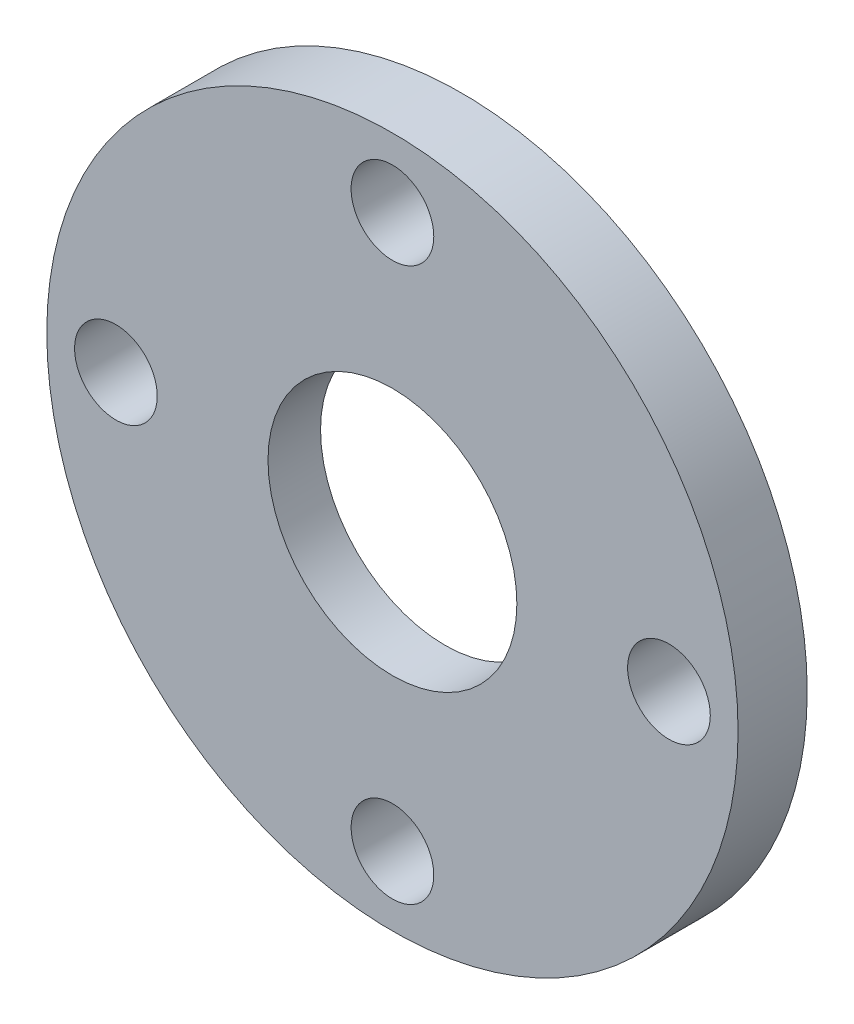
from build123d import *

# Parameters (mm, degrees)
SKETCH1_R          = 15.875
SKETCH1_R_2        = 5.715
SKETCH1_R_3        = 1.89865
BASE_EXTRUDE_DEPTH = 3.175
SKETCH2_R          = 7.9375
EXTRUDE1_DEPTH     = 0.762


with BuildPart() as part:
    # Sketch1 → Base-Extrude (new body)
    with BuildSketch(Plane.XY):
        Circle(SKETCH1_R)
        Circle(SKETCH1_R_2, mode=Mode.SUBTRACT)
        with Locations((12.7, 0)):
            Circle(SKETCH1_R_3, mode=Mode.SUBTRACT)
        with Locations((0, 12.7)):
            Circle(SKETCH1_R_3, mode=Mode.SUBTRACT)
        with Locations(Location((-12.7, 0, 0), (0, 0, 180))):
            Circle(SKETCH1_R_3, mode=Mode.SUBTRACT)
        with Locations(Location((0, -12.7, 0), (0, 0, 180))):
            Circle(SKETCH1_R_3, mode=Mode.SUBTRACT)
    extrude(amount=BASE_EXTRUDE_DEPTH)

    # Sketch2 → Extrude1 (cut)
    with BuildSketch(Plane.XY):
        with Locations(Location((0, 0, 0), (0, 0, 180))):
            Circle(SKETCH2_R)
    extrude(amount=EXTRUDE1_DEPTH, mode=Mode.SUBTRACT)


solid = part.part
